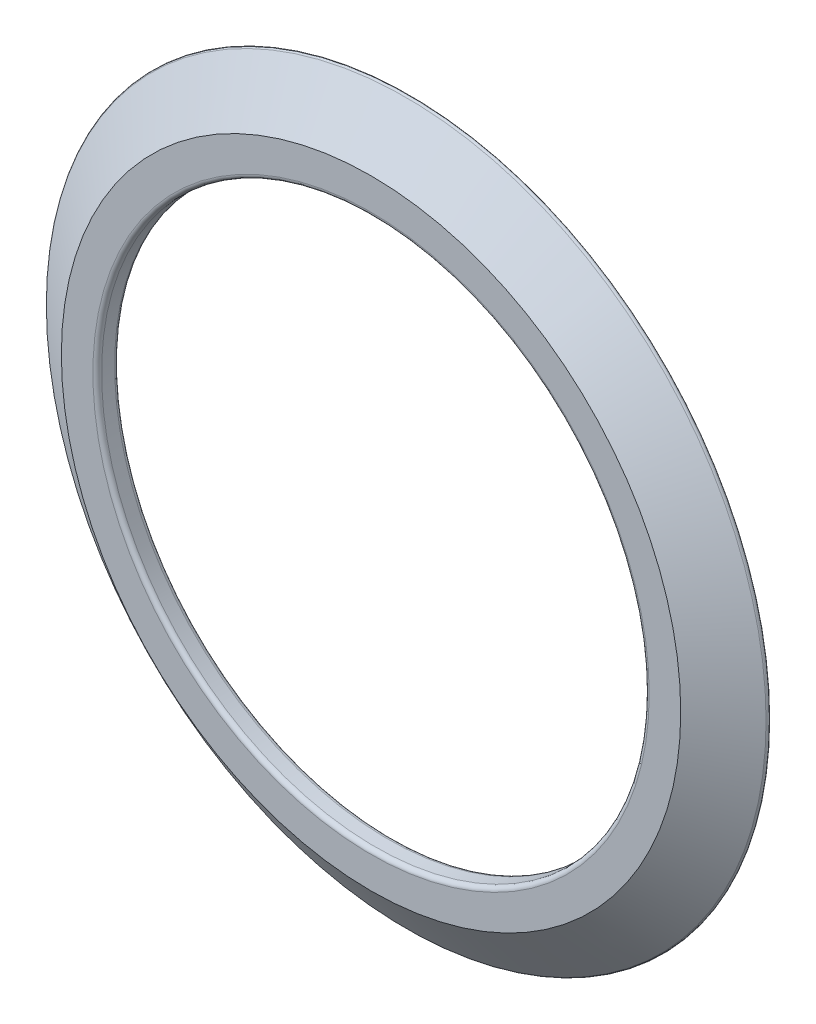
ISO-10303-21;
HEADER;
FILE_DESCRIPTION(('STEP AP214'),'2;1');
FILE_NAME('part.step','',(''),(''),'','','');
FILE_SCHEMA(('AUTOMOTIVE_DESIGN { 1 0 10303 214 1 1 1 1 }'));
ENDSEC;
DATA;
#1=APPLICATION_CONTEXT('core data for automotive mechanical design processes');
#2=APPLICATION_PROTOCOL_DEFINITION('international standard','automotive_design',2000,#1);
#3=PRODUCT_CONTEXT('',#1,'mechanical');
#4=PRODUCT('Part','Part','',(#3));
#5=PRODUCT_RELATED_PRODUCT_CATEGORY('part','',(#4));
#6=PRODUCT_DEFINITION_FORMATION('','',#4);
#7=PRODUCT_DEFINITION_CONTEXT('part definition',#1,'design');
#8=PRODUCT_DEFINITION('design','',#6,#7);
#9=PRODUCT_DEFINITION_SHAPE('','',#8);
#10=(LENGTH_UNIT() NAMED_UNIT(*) SI_UNIT(.MILLI.,.METRE.));
#11=(NAMED_UNIT(*) PLANE_ANGLE_UNIT() SI_UNIT($,.RADIAN.));
#12=(NAMED_UNIT(*) SI_UNIT($,.STERADIAN.) SOLID_ANGLE_UNIT());
#13=UNCERTAINTY_MEASURE_WITH_UNIT(LENGTH_MEASURE(1.E-05),#10,'distance_accuracy_value','');
#14=(GEOMETRIC_REPRESENTATION_CONTEXT(3) GLOBAL_UNCERTAINTY_ASSIGNED_CONTEXT((#13)) GLOBAL_UNIT_ASSIGNED_CONTEXT((#10,
#11,#12)) REPRESENTATION_CONTEXT('',''));
#15=CARTESIAN_POINT('',(0.,0.,0.));
#16=DIRECTION('',(0.,0.,1.));
#17=DIRECTION('',(1.,0.,0.));
#18=AXIS2_PLACEMENT_3D('',#15,#16,#17);
#19=CARTESIAN_POINT('',(0.,0.,0.175804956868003));
#20=DIRECTION('',(0.,0.,-1.));
#21=DIRECTION('',(-1.,0.,0.));
#22=AXIS2_PLACEMENT_3D('',#19,#20,#21);
#23=CONICAL_SURFACE('',#22,16.557416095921,0.959217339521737);
#24=CARTESIAN_POINT('',(0.,0.,1.793930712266));
#25=DIRECTION('',(0.,0.,1.));
#26=DIRECTION('',(1.,0.,0.));
#27=AXIS2_PLACEMENT_3D('',#24,#25,#26);
#28=CIRCLE('',#27,14.25);
#29=CARTESIAN_POINT('',(14.25,0.,1.793930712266));
#30=VERTEX_POINT('',#29);
#31=EDGE_CURVE('E8',#30,#30,#28,.T.);
#32=ORIENTED_EDGE('',*,*,#31,.F.);
#33=EDGE_LOOP('',(#32));
#34=FACE_BOUND('',#33,.T.);
#35=CARTESIAN_POINT('',(0.,0.,0.175804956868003));
#36=DIRECTION('',(0.,0.,1.));
#37=DIRECTION('',(1.,0.,0.));
#38=AXIS2_PLACEMENT_3D('',#35,#36,#37);
#39=CIRCLE('',#38,16.557416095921);
#40=CARTESIAN_POINT('',(16.557416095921,0.,0.175804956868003));
#41=VERTEX_POINT('',#40);
#42=EDGE_CURVE('E40',#41,#41,#39,.T.);
#43=ORIENTED_EDGE('',*,*,#42,.T.);
#44=EDGE_LOOP('',(#43));
#45=FACE_BOUND('',#44,.T.);
#46=ADVANCED_FACE('F12',(#34,#45),#23,.T.);
#47=CARTESIAN_POINT('',(0.,14.25,1.793930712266));
#48=DIRECTION('',(0.,0.,-1.));
#49=DIRECTION('',(-1.,0.,0.));
#50=AXIS2_PLACEMENT_3D('',#47,#48,#49);
#51=PLANE('',#50);
#52=CARTESIAN_POINT('',(0.,0.,1.793930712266));
#53=DIRECTION('',(0.,0.,1.));
#54=DIRECTION('',(1.,0.,0.));
#55=AXIS2_PLACEMENT_3D('',#52,#53,#54);
#56=CIRCLE('',#55,12.8);
#57=CARTESIAN_POINT('',(12.8,0.,1.793930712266));
#58=VERTEX_POINT('',#57);
#59=EDGE_CURVE('E18',#58,#58,#56,.T.);
#60=ORIENTED_EDGE('',*,*,#59,.F.);
#61=EDGE_LOOP('',(#60));
#62=FACE_BOUND('',#61,.T.);
#63=ORIENTED_EDGE('',*,*,#31,.T.);
#64=EDGE_LOOP('',(#63));
#65=FACE_BOUND('',#64,.T.);
#66=ADVANCED_FACE('F77',(#62,#65),#51,.F.);
#67=CARTESIAN_POINT('',(0.,0.,1.59393071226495));
#68=DIRECTION('',(0.,0.,1.));
#69=DIRECTION('',(1.,0.,0.));
#70=AXIS2_PLACEMENT_3D('',#67,#68,#69);
#71=TOROIDAL_SURFACE('',#70,12.8000000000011,0.200000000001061);
#72=CARTESIAN_POINT('',(0.,0.,1.593930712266));
#73=DIRECTION('',(0.,0.,1.));
#74=DIRECTION('',(1.,0.,0.));
#75=AXIS2_PLACEMENT_3D('',#72,#73,#74);
#76=CIRCLE('',#75,12.6);
#77=CARTESIAN_POINT('',(12.6,0.,1.593930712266));
#78=VERTEX_POINT('',#77);
#79=EDGE_CURVE('E22',#78,#78,#76,.T.);
#80=ORIENTED_EDGE('',*,*,#79,.F.);
#81=EDGE_LOOP('',(#80));
#82=FACE_BOUND('',#81,.T.);
#83=ORIENTED_EDGE('',*,*,#59,.T.);
#84=EDGE_LOOP('',(#83));
#85=FACE_BOUND('',#84,.T.);
#86=ADVANCED_FACE('F72',(#82,#85),#71,.T.);
#87=CARTESIAN_POINT('',(0.,0.,-0.00606928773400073));
#88=DIRECTION('',(0.,0.,1.));
#89=DIRECTION('',(1.,0.,0.));
#90=AXIS2_PLACEMENT_3D('',#87,#88,#89);
#91=CYLINDRICAL_SURFACE('',#90,12.6);
#92=CARTESIAN_POINT('',(0.,0.,0.993930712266));
#93=DIRECTION('',(0.,0.,1.));
#94=DIRECTION('',(1.,0.,0.));
#95=AXIS2_PLACEMENT_3D('',#92,#93,#94);
#96=CIRCLE('',#95,12.6);
#97=CARTESIAN_POINT('',(12.6,0.,0.993930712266));
#98=VERTEX_POINT('',#97);
#99=EDGE_CURVE('E26',#98,#98,#96,.T.);
#100=ORIENTED_EDGE('',*,*,#99,.F.);
#101=EDGE_LOOP('',(#100));
#102=FACE_BOUND('',#101,.T.);
#103=ORIENTED_EDGE('',*,*,#79,.T.);
#104=EDGE_LOOP('',(#103));
#105=FACE_BOUND('',#104,.T.);
#106=ADVANCED_FACE('F66',(#102,#105),#91,.F.);
#107=CARTESIAN_POINT('',(0.,0.,0.993930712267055));
#108=DIRECTION('',(0.,0.,1.));
#109=DIRECTION('',(1.,0.,0.));
#110=AXIS2_PLACEMENT_3D('',#107,#108,#109);
#111=TOROIDAL_SURFACE('',#110,12.8000000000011,0.200000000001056);
#112=CARTESIAN_POINT('',(0.,0.,0.793930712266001));
#113=DIRECTION('',(0.,0.,1.));
#114=DIRECTION('',(1.,0.,0.));
#115=AXIS2_PLACEMENT_3D('',#112,#113,#114);
#116=CIRCLE('',#115,12.8000000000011);
#117=CARTESIAN_POINT('',(12.8000000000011,0.,0.793930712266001));
#118=VERTEX_POINT('',#117);
#119=EDGE_CURVE('E31',#118,#118,#116,.T.);
#120=ORIENTED_EDGE('',*,*,#119,.F.);
#121=EDGE_LOOP('',(#120));
#122=FACE_BOUND('',#121,.T.);
#123=ORIENTED_EDGE('',*,*,#99,.T.);
#124=EDGE_LOOP('',(#123));
#125=FACE_BOUND('',#124,.T.);
#126=ADVANCED_FACE('F60',(#122,#125),#111,.T.);
#127=CARTESIAN_POINT('',(0.,12.8,0.793930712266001));
#128=DIRECTION('',(0.,0.,1.));
#129=DIRECTION('',(1.,0.,0.));
#130=AXIS2_PLACEMENT_3D('',#127,#128,#129);
#131=PLANE('',#130);
#132=CARTESIAN_POINT('',(0.,0.,0.793930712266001));
#133=DIRECTION('',(0.,0.,1.));
#134=DIRECTION('',(1.,0.,0.));
#135=AXIS2_PLACEMENT_3D('',#132,#133,#134);
#136=CIRCLE('',#135,14.292);
#137=CARTESIAN_POINT('',(14.292,0.,0.793930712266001));
#138=VERTEX_POINT('',#137);
#139=EDGE_CURVE('E34',#138,#138,#136,.T.);
#140=ORIENTED_EDGE('',*,*,#139,.F.);
#141=EDGE_LOOP('',(#140));
#142=FACE_BOUND('',#141,.T.);
#143=ORIENTED_EDGE('',*,*,#119,.T.);
#144=EDGE_LOOP('',(#143));
#145=FACE_BOUND('',#144,.T.);
#146=ADVANCED_FACE('F54',(#142,#145),#131,.F.);
#147=CARTESIAN_POINT('',(0.,0.,0.793930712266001));
#148=DIRECTION('',(0.,0.,-1.));
#149=DIRECTION('',(-1.,0.,0.));
#150=AXIS2_PLACEMENT_3D('',#147,#148,#149);
#151=CONICAL_SURFACE('',#150,14.292,1.2206050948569);
#152=CARTESIAN_POINT('',(0.,0.,0.));
#153=DIRECTION('',(0.,0.,1.));
#154=DIRECTION('',(1.,0.,0.));
#155=AXIS2_PLACEMENT_3D('',#152,#153,#154);
#156=CIRCLE('',#155,16.465692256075);
#157=CARTESIAN_POINT('',(16.465692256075,0.,0.));
#158=VERTEX_POINT('',#157);
#159=EDGE_CURVE('E37',#158,#158,#156,.T.);
#160=ORIENTED_EDGE('',*,*,#159,.F.);
#161=EDGE_LOOP('',(#160));
#162=FACE_BOUND('',#161,.T.);
#163=ORIENTED_EDGE('',*,*,#139,.T.);
#164=EDGE_LOOP('',(#163));
#165=FACE_BOUND('',#164,.T.);
#166=ADVANCED_FACE('F48',(#162,#165),#151,.F.);
#167=CARTESIAN_POINT('',(0.,0.,0.0939307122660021));
#168=DIRECTION('',(0.,0.,1.));
#169=DIRECTION('',(1.,0.,0.));
#170=AXIS2_PLACEMENT_3D('',#167,#168,#169);
#171=TOROIDAL_SURFACE('',#170,16.4999999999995,0.100000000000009);
#172=ORIENTED_EDGE('',*,*,#42,.F.);
#173=EDGE_LOOP('',(#172));
#174=FACE_BOUND('',#173,.T.);
#175=ORIENTED_EDGE('',*,*,#159,.T.);
#176=EDGE_LOOP('',(#175));
#177=FACE_BOUND('',#176,.T.);
#178=ADVANCED_FACE('F45',(#174,#177),#171,.T.);
#179=CLOSED_SHELL('',(#46,#66,#86,#106,#126,#146,#166,#178));
#180=MANIFOLD_SOLID_BREP('B1',#179);
#181=ADVANCED_BREP_SHAPE_REPRESENTATION('',(#18,#180),#14);
#182=SHAPE_DEFINITION_REPRESENTATION(#9,#181);
ENDSEC;
END-ISO-10303-21;
